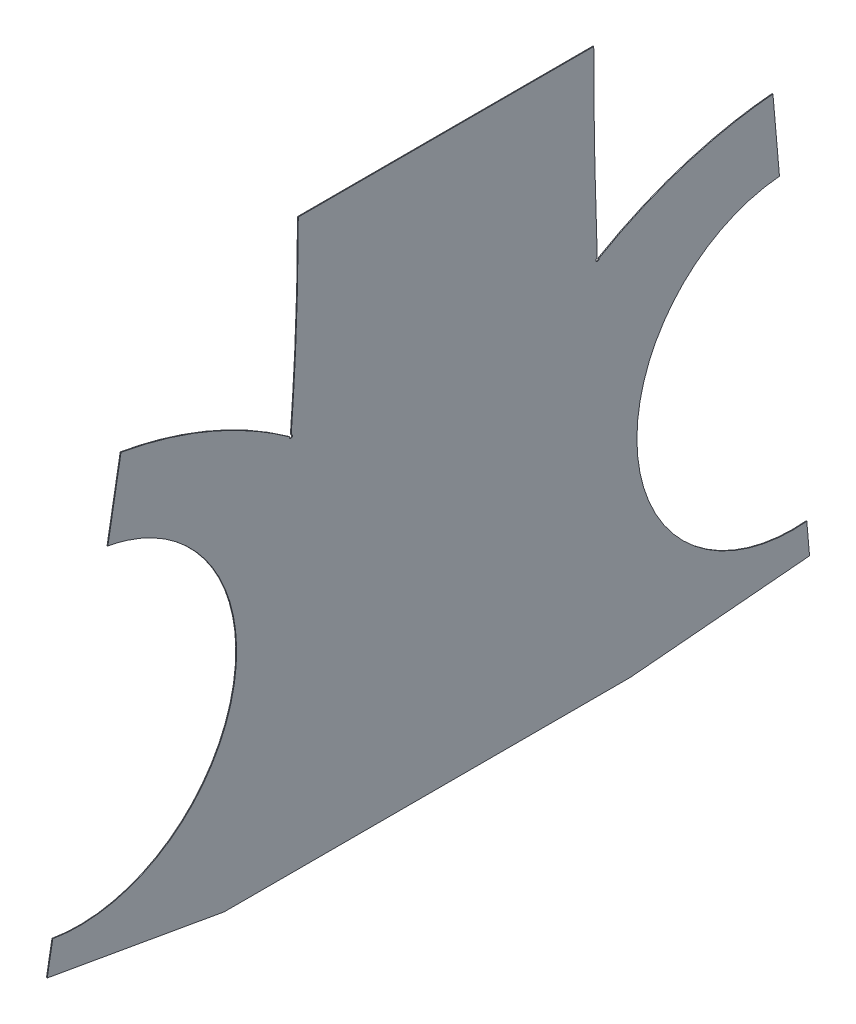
ISO-10303-21;
HEADER;
FILE_DESCRIPTION(('STEP AP214'),'2;1');
FILE_NAME('part.step','',(''),(''),'','','');
FILE_SCHEMA(('AUTOMOTIVE_DESIGN { 1 0 10303 214 1 1 1 1 }'));
ENDSEC;
DATA;
#1=APPLICATION_CONTEXT('core data for automotive mechanical design processes');
#2=APPLICATION_PROTOCOL_DEFINITION('international standard','automotive_design',2000,#1);
#3=PRODUCT_CONTEXT('',#1,'mechanical');
#4=PRODUCT('Part','Part','',(#3));
#5=PRODUCT_RELATED_PRODUCT_CATEGORY('part','',(#4));
#6=PRODUCT_DEFINITION_FORMATION('','',#4);
#7=PRODUCT_DEFINITION_CONTEXT('part definition',#1,'design');
#8=PRODUCT_DEFINITION('design','',#6,#7);
#9=PRODUCT_DEFINITION_SHAPE('','',#8);
#10=(LENGTH_UNIT() NAMED_UNIT(*) SI_UNIT(.MILLI.,.METRE.));
#11=(NAMED_UNIT(*) PLANE_ANGLE_UNIT() SI_UNIT($,.RADIAN.));
#12=(NAMED_UNIT(*) SI_UNIT($,.STERADIAN.) SOLID_ANGLE_UNIT());
#13=UNCERTAINTY_MEASURE_WITH_UNIT(LENGTH_MEASURE(1.E-05),#10,'distance_accuracy_value','');
#14=(GEOMETRIC_REPRESENTATION_CONTEXT(3) GLOBAL_UNCERTAINTY_ASSIGNED_CONTEXT((#13)) GLOBAL_UNIT_ASSIGNED_CONTEXT((#10,
#11,#12)) REPRESENTATION_CONTEXT('',''));
#15=CARTESIAN_POINT('',(0.,0.,0.));
#16=DIRECTION('',(0.,0.,1.));
#17=DIRECTION('',(1.,0.,0.));
#18=AXIS2_PLACEMENT_3D('',#15,#16,#17);
#19=CARTESIAN_POINT('',(-1.,0.,520.));
#20=DIRECTION('',(1.,0.,0.));
#21=DIRECTION('',(0.,0.,-1.));
#22=AXIS2_PLACEMENT_3D('',#19,#20,#21);
#23=PLANE('',#22);
#24=CARTESIAN_POINT('',(-1.,484.183526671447,434.625380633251));
#25=DIRECTION('',(1.,0.,0.));
#26=DIRECTION('',(0.,0.,-1.));
#27=AXIS2_PLACEMENT_3D('',#24,#25,#26);
#28=CIRCLE('',#27,2.);
#29=CARTESIAN_POINT('',(-0.999999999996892,484.857108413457,436.508539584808));
#30=VERTEX_POINT('',#29);
#31=CARTESIAN_POINT('',(-0.999999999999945,485.877678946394,433.562437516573));
#32=VERTEX_POINT('',#31);
#33=EDGE_CURVE('E349',#30,#32,#28,.T.);
#34=ORIENTED_EDGE('',*,*,#33,.T.);
#35=CARTESIAN_POINT('',(-0.999999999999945,487.848674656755,433.223061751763));
#36=DIRECTION('',(1.,0.,0.));
#37=DIRECTION('',(0.,1.,0.));
#38=AXIS2_PLACEMENT_3D('',#35,#36,#37);
#39=CIRCLE('',#38,1.99999999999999);
#40=CARTESIAN_POINT('',(-1.,486.154522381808,434.28600486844));
#41=VERTEX_POINT('',#40);
#42=EDGE_CURVE('E335',#41,#32,#39,.T.);
#43=ORIENTED_EDGE('',*,*,#42,.F.);
#44=CARTESIAN_POINT('',(-1.,722.888792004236,425.224247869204));
#45=CARTESIAN_POINT('',(-1.,660.412146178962,425.356499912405));
#46=CARTESIAN_POINT('',(-1.,604.436673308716,427.520691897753));
#47=CARTESIAN_POINT('',(-1.,551.397981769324,429.571338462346));
#48=CARTESIAN_POINT('',(-1.,486.154522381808,434.28600486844));
#49=B_SPLINE_CURVE_WITH_KNOTS('',2,(#44,#45,#46,#47,#48),.UNSPECIFIED.,.F.,.F.,(3,2,3),(0.,0.5,
1.),.UNSPECIFIED.);
#50=CARTESIAN_POINT('',(-1.00000000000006,722.888792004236,425.224247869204));
#51=VERTEX_POINT('',#50);
#52=EDGE_CURVE('E344',#51,#41,#49,.T.);
#53=ORIENTED_EDGE('',*,*,#52,.F.);
#54=DIRECTION('',(0.,0.,1.));
#55=VECTOR('',#54,1.);
#56=CARTESIAN_POINT('',(-1.,722.888792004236,238.4929751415));
#57=LINE('',#56,#55);
#58=CARTESIAN_POINT('',(-1.,722.888792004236,47.0251566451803));
#59=VERTEX_POINT('',#58);
#60=EDGE_CURVE('E343',#59,#51,#57,.T.);
#61=ORIENTED_EDGE('',*,*,#60,.F.);
#62=CARTESIAN_POINT('',(-1.,486.17634519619,42.529904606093));
#63=CARTESIAN_POINT('',(-1.,524.706977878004,43.8820597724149));
#64=CARTESIAN_POINT('',(-1.,545.336556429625,44.467634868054));
#65=CARTESIAN_POINT('',(-1.,573.439250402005,45.265335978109));
#66=CARTESIAN_POINT('',(-1.,604.51209675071,45.8560135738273));
#67=CARTESIAN_POINT('',(-1.,635.700512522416,46.4488880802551));
#68=CARTESIAN_POINT('',(-1.,663.697658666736,46.7170416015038));
#69=CARTESIAN_POINT('',(-1.,684.13104071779,46.9127502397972));
#70=CARTESIAN_POINT('',(-1.,722.888792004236,47.0251566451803));
#71=B_SPLINE_CURVE_WITH_KNOTS('',2,(#62,#63,#64,#65,#66,#67,#68,#69,#70),.UNSPECIFIED.,.F.,.F.,
(3,2,2,2,3),(0.,0.25,0.5,0.75,1.),.UNSPECIFIED.);
#72=CARTESIAN_POINT('',(-1.,486.176345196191,42.5299046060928));
#73=VERTEX_POINT('',#72);
#74=EDGE_CURVE('E357',#73,#59,#71,.T.);
#75=ORIENTED_EDGE('',*,*,#74,.F.);
#76=CARTESIAN_POINT('',(-1.,484.183526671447,42.36056964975));
#77=DIRECTION('',(1.,0.,0.));
#78=DIRECTION('',(0.,0.,-1.));
#79=AXIS2_PLACEMENT_3D('',#76,#77,#78);
#80=CIRCLE('',#79,2.);
#81=CARTESIAN_POINT('',(-0.999999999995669,484.658809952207,40.4178638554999));
#82=VERTEX_POINT('',#81);
#83=EDGE_CURVE('E425',#73,#82,#80,.T.);
#84=ORIENTED_EDGE('',*,*,#83,.T.);
#85=CARTESIAN_POINT('',(-0.999999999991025,484.312474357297,41.0096870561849));
#86=CARTESIAN_POINT('',(-0.999999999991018,486.837717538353,36.700865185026));
#87=CARTESIAN_POINT('',(-0.999999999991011,489.30251419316,32.3566209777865));
#88=CARTESIAN_POINT('',(-0.999999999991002,494.109517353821,23.6005346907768));
#89=CARTESIAN_POINT('',(-0.999999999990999,496.451717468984,19.1886891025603));
#90=CARTESIAN_POINT('',(-0.999999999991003,501.011102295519,10.3020022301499));
#91=CARTESIAN_POINT('',(-0.99999999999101,503.22831239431,5.82717397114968));
#92=CARTESIAN_POINT('',(-0.999999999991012,507.536296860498,-3.18265090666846));
#93=CARTESIAN_POINT('',(-0.999999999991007,509.627077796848,-7.71764438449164));
#94=CARTESIAN_POINT('',(-0.999999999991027,513.680618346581,-16.8447541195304));
#95=CARTESIAN_POINT('',(-0.999999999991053,515.64337175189,-21.436873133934));
#96=CARTESIAN_POINT('',(-0.999999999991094,519.439295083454,-30.6742584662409));
#97=CARTESIAN_POINT('',(-0.999999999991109,521.272467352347,-35.3195238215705));
#98=CARTESIAN_POINT('',(-0.999999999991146,524.808129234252,-44.6603772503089));
#99=CARTESIAN_POINT('',(-0.999999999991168,526.510598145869,-49.3559731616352));
#100=CARTESIAN_POINT('',(-0.999999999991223,529.783201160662,-58.7933765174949));
#101=CARTESIAN_POINT('',(-0.999999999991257,531.353326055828,-63.5351871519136));
#102=CARTESIAN_POINT('',(-0.999999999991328,534.803559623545,-74.4673308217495));
#103=CARTESIAN_POINT('',(-0.999999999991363,536.638339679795,-80.6720291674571));
#104=CARTESIAN_POINT('',(-0.999999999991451,540.081475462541,-93.144980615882));
#105=CARTESIAN_POINT('',(-0.999999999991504,541.689792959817,-99.4132442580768));
#106=CARTESIAN_POINT('',(-0.999999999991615,544.677605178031,-112.00466000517));
#107=CARTESIAN_POINT('',(-0.999999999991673,546.05708039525,-118.327816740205));
#108=CARTESIAN_POINT('',(-0.999999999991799,548.586827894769,-131.029896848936));
#109=CARTESIAN_POINT('',(-0.999999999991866,549.736745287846,-137.408890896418));
#110=CARTESIAN_POINT('',(-0.999999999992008,551.803423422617,-150.204022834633));
#111=CARTESIAN_POINT('',(-0.999999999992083,552.720202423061,-156.620157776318));
#112=CARTESIAN_POINT('',(-0.99999999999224,554.319362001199,-169.480560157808));
#113=CARTESIAN_POINT('',(-0.999999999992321,555.001778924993,-175.924823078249));
#114=CARTESIAN_POINT('',(-0.999999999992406,555.566477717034,-182.379394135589));
#115=B_SPLINE_CURVE_WITH_KNOTS('',3,(#85,#86,#87,#88,#89,#90,#91,#92,#93,#94,#95,#96,#97,#98,
#99,#100,#101,#102,#103,#104,#105,#106,#107,#108,#109,#110,#111,#112,#113,#114),.UNSPECIFIED.,
.F.,.F.,(4,2,2,2,2,2,2,2,2,2,2,2,2,2,4),(0.,14.9823351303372,29.9654504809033,44.945511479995,
59.9247934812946,74.904801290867,89.8845382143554,104.866642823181,119.849788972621,
139.256211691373,158.665906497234,178.077254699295,197.518383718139,216.957989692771,
236.394579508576),.UNSPECIFIED.);
#116=CARTESIAN_POINT('',(-0.999999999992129,555.566477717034,-182.379394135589));
#117=VERTEX_POINT('',#116);
#118=EDGE_CURVE('E432',#82,#117,#115,.T.);
#119=ORIENTED_EDGE('',*,*,#118,.T.);
#120=DIRECTION('',(0.,-0.996194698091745,-0.0871557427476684));
#121=VECTOR('',#120,1.);
#122=CARTESIAN_POINT('',(-1.00000000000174,20.0550762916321,-229.230570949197));
#123=LINE('',#122,#121);
#124=CARTESIAN_POINT('',(-0.999999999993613,460.055076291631,-190.735558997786));
#125=VERTEX_POINT('',#124);
#126=EDGE_CURVE('E483',#117,#125,#123,.T.);
#127=ORIENTED_EDGE('',*,*,#126,.T.);
#128=CARTESIAN_POINT('',(-1.000000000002,260.055076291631,-208.23329170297));
#129=DIRECTION('',(1.,0.,0.));
#130=DIRECTION('',(0.,-0.996194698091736,-0.0871557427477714));
#131=AXIS2_PLACEMENT_3D('',#128,#129,#130);
#132=ELLIPSE('',#131,200.76396750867,200.);
#133=CARTESIAN_POINT('',(-1.000000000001,60.0550762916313,-225.73102440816));
#134=VERTEX_POINT('',#133);
#135=EDGE_CURVE('E522',#134,#125,#132,.F.);
#136=ORIENTED_EDGE('',*,*,#135,.F.);
#137=CARTESIAN_POINT('',(-1.00000000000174,20.0550762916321,-229.230570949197));
#138=VERTEX_POINT('',#137);
#139=EDGE_CURVE('E505',#134,#138,#123,.T.);
#140=ORIENTED_EDGE('',*,*,#139,.T.);
#141=DIRECTION('',(0.,-0.0871557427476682,0.996194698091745));
#142=VECTOR('',#141,1.);
#143=CARTESIAN_POINT('',(-1.00000000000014,0.0310443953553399,-0.354839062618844));
#144=LINE('',#143,#142);
#145=CARTESIAN_POINT('',(-1.00000000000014,0.118200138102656,-1.35103376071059));
#146=VERTEX_POINT('',#145);
#147=EDGE_CURVE('E503',#138,#146,#144,.T.);
#148=ORIENTED_EDGE('',*,*,#147,.T.);
#149=DIRECTION('',(0.,0.0501311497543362,-0.998742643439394));
#150=VECTOR('',#149,1.);
#151=CARTESIAN_POINT('',(-1.00000000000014,-1.66172871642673E-13,1.0038198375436));
#152=LINE('',#151,#150);
#153=CARTESIAN_POINT('',(-0.999999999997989,-1.11022302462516E-13,1.0038198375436));
#154=VERTEX_POINT('',#153);
#155=EDGE_CURVE('E534',#154,#146,#152,.T.);
#156=ORIENTED_EDGE('',*,*,#155,.F.);
#157=DIRECTION('',(0.,0.,-1.));
#158=VECTOR('',#157,1.);
#159=CARTESIAN_POINT('',(-1.,0.,520.));
#160=LINE('',#159,#158);
#161=CARTESIAN_POINT('',(-0.99999999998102,2.71511380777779E-13,518.984573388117));
#162=VERTEX_POINT('',#161);
#163=EDGE_CURVE('E220',#162,#154,#160,.T.);
#164=ORIENTED_EDGE('',*,*,#163,.F.);
#165=DIRECTION('',(0.,-0.0996708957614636,-0.995020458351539));
#166=VECTOR('',#165,1.);
#167=CARTESIAN_POINT('',(-0.999999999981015,0.235500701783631,521.335590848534));
#168=LINE('',#167,#166);
#169=CARTESIAN_POINT('',(-0.999999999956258,0.235500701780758,521.335590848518));
#170=VERTEX_POINT('',#169);
#171=EDGE_CURVE('E213',#170,#162,#168,.T.);
#172=ORIENTED_EDGE('',*,*,#171,.F.);
#173=DIRECTION('',(0.,0.173648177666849,0.984807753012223));
#174=VECTOR('',#173,1.);
#175=CARTESIAN_POINT('',(-0.999999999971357,39.9575213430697,746.610364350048));
#176=LINE('',#175,#174);
#177=CARTESIAN_POINT('',(-0.999999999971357,39.9575213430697,746.610364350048));
#178=VERTEX_POINT('',#177);
#179=EDGE_CURVE('E596',#170,#178,#176,.T.);
#180=ORIENTED_EDGE('',*,*,#179,.T.);
#181=DIRECTION('',(0.,0.984807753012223,-0.173648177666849));
#182=VECTOR('',#181,1.);
#183=CARTESIAN_POINT('',(-1.00000000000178,575.502867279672,652.179270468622));
#184=LINE('',#183,#182);
#185=CARTESIAN_POINT('',(-0.999999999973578,79.8710289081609,739.572536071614));
#186=VERTEX_POINT('',#185);
#187=EDGE_CURVE('E593',#178,#186,#184,.T.);
#188=ORIENTED_EDGE('',*,*,#187,.T.);
#189=CARTESIAN_POINT('',(-0.999999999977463,279.87102890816,704.307139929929));
#190=DIRECTION('',(1.,0.,0.));
#191=DIRECTION('',(0.,0.984807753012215,-0.173648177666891));
#192=AXIS2_PLACEMENT_3D('',#189,#190,#191);
#193=ELLIPSE('',#192,203.085322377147,200.);
#194=CARTESIAN_POINT('',(-0.999999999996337,479.871028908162,669.041743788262));
#195=VERTEX_POINT('',#194);
#196=EDGE_CURVE('E643',#195,#186,#193,.F.);
#197=ORIENTED_EDGE('',*,*,#196,.F.);
#198=CARTESIAN_POINT('',(-1.00000000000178,575.502867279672,652.179270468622));
#199=VERTEX_POINT('',#198);
#200=EDGE_CURVE('E601',#195,#199,#184,.T.);
#201=ORIENTED_EDGE('',*,*,#200,.T.);
#202=CARTESIAN_POINT('',(-0.999999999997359,484.857109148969,436.508539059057));
#203=CARTESIAN_POINT('',(-0.999999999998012,496.211562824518,452.393505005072));
#204=CARTESIAN_POINT('',(-0.999999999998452,506.682876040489,468.893920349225));
#205=CARTESIAN_POINT('',(-0.999999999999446,525.844742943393,503.126230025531));
#206=CARTESIAN_POINT('',(-1.,534.513294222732,520.870057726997));
#207=CARTESIAN_POINT('',(-1.00000000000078,549.81034196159,557.200968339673));
#208=CARTESIAN_POINT('',(-1.00000000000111,556.43880078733,575.787961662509));
#209=CARTESIAN_POINT('',(-1.00000000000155,567.5750605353,613.579173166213));
#210=CARTESIAN_POINT('',(-1.00000000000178,572.082834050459,632.783298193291));
#211=CARTESIAN_POINT('',(-1.00000000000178,575.502867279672,652.179270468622));
#212=B_SPLINE_CURVE_WITH_KNOTS('',3,(#202,#203,#204,#205,#206,#207,#208,#209,#210,#211),
.UNSPECIFIED.,.F.,.F.,(4,2,2,2,4),(0.,0.247146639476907,0.497146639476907,0.747146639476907,
0.997146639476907),.UNSPECIFIED.);
#213=EDGE_CURVE('E582',#199,#30,#212,.F.);
#214=ORIENTED_EDGE('',*,*,#213,.T.);
#215=EDGE_LOOP('',(#34,#43,#53,#61,#75,#84,#119,#127,#136,#140,#148,#156,#164,#172,#180,#188,
#197,#201,#214));
#216=FACE_BOUND('',#215,.T.);
#217=ADVANCED_FACE('F196',(#216),#23,.F.);
#218=CARTESIAN_POINT('',(0.,0.,520.));
#219=DIRECTION('',(1.,0.,0.));
#220=DIRECTION('',(0.,0.,-1.));
#221=AXIS2_PLACEMENT_3D('',#218,#219,#220);
#222=PLANE('',#221);
#223=CARTESIAN_POINT('',(0.,484.183526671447,42.36056964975));
#224=DIRECTION('',(1.,0.,0.));
#225=DIRECTION('',(0.,0.,-1.));
#226=AXIS2_PLACEMENT_3D('',#223,#224,#225);
#227=CIRCLE('',#226,2.);
#228=CARTESIAN_POINT('',(0.,486.17634519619,42.5299046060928));
#229=VERTEX_POINT('',#228);
#230=CARTESIAN_POINT('',(8.97409504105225E-12,484.658809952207,40.4178638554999));
#231=VERTEX_POINT('',#230);
#232=EDGE_CURVE('E415',#229,#231,#227,.T.);
#233=ORIENTED_EDGE('',*,*,#232,.F.);
#234=CARTESIAN_POINT('',(0.,486.17634519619,42.529904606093));
#235=CARTESIAN_POINT('',(0.,524.706977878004,43.8820597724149));
#236=CARTESIAN_POINT('',(0.,545.336556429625,44.467634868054));
#237=CARTESIAN_POINT('',(0.,573.439250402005,45.265335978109));
#238=CARTESIAN_POINT('',(0.,604.51209675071,45.8560135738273));
#239=CARTESIAN_POINT('',(0.,635.700512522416,46.4488880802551));
#240=CARTESIAN_POINT('',(0.,663.697658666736,46.7170416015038));
#241=CARTESIAN_POINT('',(0.,684.13104071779,46.9127502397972));
#242=CARTESIAN_POINT('',(0.,722.888792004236,47.0251566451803));
#243=B_SPLINE_CURVE_WITH_KNOTS('',2,(#234,#235,#236,#237,#238,#239,#240,#241,#242),
.UNSPECIFIED.,.F.,.F.,(3,2,2,2,3),(0.,0.25,0.5,0.75,1.),.UNSPECIFIED.);
#244=CARTESIAN_POINT('',(0.,722.888792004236,47.0251566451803));
#245=VERTEX_POINT('',#244);
#246=EDGE_CURVE('E393',#229,#245,#243,.T.);
#247=ORIENTED_EDGE('',*,*,#246,.T.);
#248=DIRECTION('',(0.,0.,1.));
#249=VECTOR('',#248,1.);
#250=CARTESIAN_POINT('',(6.7168492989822E-12,722.888792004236,47.0251566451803));
#251=LINE('',#250,#249);
#252=CARTESIAN_POINT('',(6.7168492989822E-12,722.888792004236,425.224247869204));
#253=VERTEX_POINT('',#252);
#254=EDGE_CURVE('E392',#245,#253,#251,.T.);
#255=ORIENTED_EDGE('',*,*,#254,.T.);
#256=CARTESIAN_POINT('',(0.,722.888792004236,425.224247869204));
#257=CARTESIAN_POINT('',(0.,660.412146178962,425.356499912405));
#258=CARTESIAN_POINT('',(0.,604.436673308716,427.520691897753));
#259=CARTESIAN_POINT('',(0.,551.397981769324,429.571338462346));
#260=CARTESIAN_POINT('',(0.,486.154522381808,434.28600486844));
#261=B_SPLINE_CURVE_WITH_KNOTS('',2,(#256,#257,#258,#259,#260),.UNSPECIFIED.,.F.,.F.,(3,2,3),
(0.,0.5,1.),.UNSPECIFIED.);
#262=CARTESIAN_POINT('',(0.,486.154522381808,434.28600486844));
#263=VERTEX_POINT('',#262);
#264=EDGE_CURVE('E385',#253,#263,#261,.T.);
#265=ORIENTED_EDGE('',*,*,#264,.T.);
#266=CARTESIAN_POINT('',(0.,487.848674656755,433.223061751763));
#267=DIRECTION('',(1.,0.,0.));
#268=DIRECTION('',(0.,1.,0.));
#269=AXIS2_PLACEMENT_3D('',#266,#267,#268);
#270=CIRCLE('',#269,1.99999999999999);
#271=CARTESIAN_POINT('',(0.,485.877678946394,433.562437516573));
#272=VERTEX_POINT('',#271);
#273=EDGE_CURVE('E338',#263,#272,#270,.T.);
#274=ORIENTED_EDGE('',*,*,#273,.T.);
#275=CARTESIAN_POINT('',(0.,484.183526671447,434.625380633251));
#276=DIRECTION('',(1.,0.,0.));
#277=DIRECTION('',(0.,0.,-1.));
#278=AXIS2_PLACEMENT_3D('',#275,#276,#277);
#279=CIRCLE('',#278,2.);
#280=CARTESIAN_POINT('',(3.10862446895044E-12,484.857108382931,436.508539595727));
#281=VERTEX_POINT('',#280);
#282=EDGE_CURVE('E644',#281,#272,#279,.T.);
#283=ORIENTED_EDGE('',*,*,#282,.F.);
#284=CARTESIAN_POINT('',(0.,575.502867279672,652.179270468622));
#285=CARTESIAN_POINT('',(0.,574.64276072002,647.301349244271));
#286=CARTESIAN_POINT('',(0.,573.7138521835,642.435563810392));
#287=CARTESIAN_POINT('',(0.,571.719288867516,632.731839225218));
#288=CARTESIAN_POINT('',(0.,570.653627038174,627.893901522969));
#289=CARTESIAN_POINT('',(0.,568.386763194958,618.251054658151));
#290=CARTESIAN_POINT('',(0.,567.185592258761,613.446138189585));
#291=CARTESIAN_POINT('',(0.,564.648500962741,603.872280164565));
#292=CARTESIAN_POINT('',(0.,563.312587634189,599.103336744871));
#293=CARTESIAN_POINT('',(0.,560.506839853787,589.604773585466));
#294=CARTESIAN_POINT('',(0.,559.036999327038,584.875155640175));
#295=CARTESIAN_POINT('',(0.,555.964843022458,575.459243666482));
#296=CARTESIAN_POINT('',(0.,554.362529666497,570.772948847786));
#297=CARTESIAN_POINT('',(0.,551.026472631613,561.446440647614));
#298=CARTESIAN_POINT('',(0.,549.292706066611,556.80623545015));
#299=CARTESIAN_POINT('',(0.,545.69525994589,547.576135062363));
#300=CARTESIAN_POINT('',(0.,543.831571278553,542.986243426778));
#301=CARTESIAN_POINT('',(0.,539.375432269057,532.439902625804));
#302=CARTESIAN_POINT('',(0.,536.736747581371,526.502920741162));
#303=CARTESIAN_POINT('',(0.,531.242134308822,514.729170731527));
#304=CARTESIAN_POINT('',(0.,528.386167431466,508.892420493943));
#305=CARTESIAN_POINT('',(0.,522.461137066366,497.327393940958));
#306=CARTESIAN_POINT('',(0.,519.392053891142,491.599127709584));
#307=CARTESIAN_POINT('',(0.,513.040221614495,480.250694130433));
#308=CARTESIAN_POINT('',(0.,509.757149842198,474.630707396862));
#309=CARTESIAN_POINT('',(0.,502.986842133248,463.515754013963));
#310=CARTESIAN_POINT('',(0.,499.499623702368,458.020776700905));
#311=CARTESIAN_POINT('',(0.,492.326356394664,447.16356269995));
#312=CARTESIAN_POINT('',(0.,488.640342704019,441.801302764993));
#313=CARTESIAN_POINT('',(0.,484.857109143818,436.50853905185));
#314=B_SPLINE_CURVE_WITH_KNOTS('',3,(#284,#285,#286,#287,#288,#289,#290,#291,#292,#293,#294,
#295,#296,#297,#298,#299,#300,#301,#302,#303,#304,#305,#306,#307,#308,#309,#310,#311,#312,#313),
.UNSPECIFIED.,.F.,.F.,(4,2,2,2,2,2,2,2,2,2,2,2,2,2,4),(0.,14.8590136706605,29.7187936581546,
44.5751726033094,59.4307766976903,74.2870549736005,89.1430617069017,104.001660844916,
118.861303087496,138.347557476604,157.837253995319,177.32875335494,196.850355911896,
216.370286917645,235.886774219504),.UNSPECIFIED.);
#315=CARTESIAN_POINT('',(-1.77635683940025E-12,575.502867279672,652.179270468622));
#316=VERTEX_POINT('',#315);
#317=EDGE_CURVE('E547',#316,#281,#314,.T.);
#318=ORIENTED_EDGE('',*,*,#317,.F.);
#319=DIRECTION('',(0.,0.984807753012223,-0.173648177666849));
#320=VECTOR('',#319,1.);
#321=CARTESIAN_POINT('',(-1.77635683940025E-12,575.502867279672,652.179270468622));
#322=LINE('',#321,#320);
#323=CARTESIAN_POINT('',(3.66373598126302E-12,480.044677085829,669.011124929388));
#324=VERTEX_POINT('',#323);
#325=EDGE_CURVE('E606',#324,#316,#322,.T.);
#326=ORIENTED_EDGE('',*,*,#325,.F.);
#327=CARTESIAN_POINT('',(2.24265050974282E-11,280.044677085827,704.276521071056));
#328=DIRECTION('',(1.,0.,0.));
#329=DIRECTION('',(0.,0.984807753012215,-0.173648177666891));
#330=AXIS2_PLACEMENT_3D('',#327,#328,#329);
#331=ELLIPSE('',#330,203.085322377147,200.);
#332=CARTESIAN_POINT('',(2.64233079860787E-11,80.0446770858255,739.541917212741));
#333=VERTEX_POINT('',#332);
#334=EDGE_CURVE('E603',#324,#333,#331,.F.);
#335=ORIENTED_EDGE('',*,*,#334,.T.);
#336=CARTESIAN_POINT('',(2.87547763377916E-11,39.9575213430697,746.610364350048));
#337=VERTEX_POINT('',#336);
#338=EDGE_CURVE('E612',#337,#333,#322,.T.);
#339=ORIENTED_EDGE('',*,*,#338,.F.);
#340=DIRECTION('',(0.,0.173648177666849,0.984807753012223));
#341=VECTOR('',#340,1.);
#342=CARTESIAN_POINT('',(2.87547763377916E-11,39.9575213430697,746.610364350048));
#343=LINE('',#342,#341);
#344=CARTESIAN_POINT('',(3.96349619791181E-11,0.235500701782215,521.335590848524));
#345=VERTEX_POINT('',#344);
#346=EDGE_CURVE('E586',#345,#337,#343,.T.);
#347=ORIENTED_EDGE('',*,*,#346,.F.);
#348=DIRECTION('',(0.,-0.0996708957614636,-0.995020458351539));
#349=VECTOR('',#348,1.);
#350=CARTESIAN_POINT('',(1.89854642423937E-11,0.235500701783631,521.335590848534));
#351=LINE('',#350,#349);
#352=CARTESIAN_POINT('',(1.89796257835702E-11,0.,518.984573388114));
#353=VERTEX_POINT('',#352);
#354=EDGE_CURVE('E433',#345,#353,#351,.T.);
#355=ORIENTED_EDGE('',*,*,#354,.T.);
#356=DIRECTION('',(0.,0.,-1.));
#357=VECTOR('',#356,1.);
#358=CARTESIAN_POINT('',(0.,0.,520.));
#359=LINE('',#358,#357);
#360=CARTESIAN_POINT('',(-1.42877315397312E-13,-1.66533453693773E-13,1.0038198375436));
#361=VERTEX_POINT('',#360);
#362=EDGE_CURVE('E544',#353,#361,#359,.T.);
#363=ORIENTED_EDGE('',*,*,#362,.T.);
#364=DIRECTION('',(0.,0.0501311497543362,-0.998742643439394));
#365=VECTOR('',#364,1.);
#366=CARTESIAN_POINT('',(-1.42856784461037E-13,-1.66172871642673E-13,1.0038198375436));
#367=LINE('',#366,#365);
#368=CARTESIAN_POINT('',(0.,0.118200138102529,-1.35103376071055));
#369=VERTEX_POINT('',#368);
#370=EDGE_CURVE('E426',#361,#369,#367,.T.);
#371=ORIENTED_EDGE('',*,*,#370,.T.);
#372=DIRECTION('',(0.,-0.0871557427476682,0.996194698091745));
#373=VECTOR('',#372,1.);
#374=CARTESIAN_POINT('',(-1.3586357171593E-13,0.0310443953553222,-0.354839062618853));
#375=LINE('',#374,#373);
#376=CARTESIAN_POINT('',(-1.74070379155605E-12,20.0550762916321,-229.230570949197));
#377=VERTEX_POINT('',#376);
#378=EDGE_CURVE('E508',#377,#369,#375,.T.);
#379=ORIENTED_EDGE('',*,*,#378,.F.);
#380=DIRECTION('',(0.,-0.996194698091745,-0.0871557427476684));
#381=VECTOR('',#380,1.);
#382=CARTESIAN_POINT('',(-1.74070379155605E-12,20.0550762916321,-229.230570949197));
#383=LINE('',#382,#381);
#384=CARTESIAN_POINT('',(-1.00474020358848E-12,60.1422320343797,-225.723399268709));
#385=VERTEX_POINT('',#384);
#386=EDGE_CURVE('E517',#385,#377,#383,.T.);
#387=ORIENTED_EDGE('',*,*,#386,.F.);
#388=CARTESIAN_POINT('',(-2.01565030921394E-12,260.142232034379,-208.225666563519));
#389=DIRECTION('',(1.,0.,0.));
#390=DIRECTION('',(0.,-0.996194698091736,-0.0871557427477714));
#391=AXIS2_PLACEMENT_3D('',#388,#389,#390);
#392=ELLIPSE('',#391,200.76396750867,200.);
#393=CARTESIAN_POINT('',(6.3804113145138E-12,460.14223203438,-190.727933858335));
#394=VERTEX_POINT('',#393);
#395=EDGE_CURVE('E515',#385,#394,#392,.F.);
#396=ORIENTED_EDGE('',*,*,#395,.T.);
#397=CARTESIAN_POINT('',(7.86533460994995E-12,555.566477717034,-182.379394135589));
#398=VERTEX_POINT('',#397);
#399=EDGE_CURVE('E438',#398,#394,#383,.T.);
#400=ORIENTED_EDGE('',*,*,#399,.F.);
#401=CARTESIAN_POINT('',(8.96931999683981E-12,484.312477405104,41.0096818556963));
#402=CARTESIAN_POINT('',(8.97854698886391E-12,486.812617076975,36.7436935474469));
#403=CARTESIAN_POINT('',(8.98409307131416E-12,489.253506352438,32.4429837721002));
#404=CARTESIAN_POINT('',(8.99090369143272E-12,494.015136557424,23.7752720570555));
#405=CARTESIAN_POINT('',(8.99216801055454E-12,496.335871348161,19.4082667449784));
#406=CARTESIAN_POINT('',(8.99349491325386E-12,500.854771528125,10.6125589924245));
#407=CARTESIAN_POINT('',(8.99355777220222E-12,503.052964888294,6.18387092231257));
#408=CARTESIAN_POINT('',(8.97398830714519E-12,507.325582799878,-2.73279745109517));
#409=CARTESIAN_POINT('',(8.95435604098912E-12,509.400007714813,-7.22077758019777));
#410=CARTESIAN_POINT('',(8.93393314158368E-12,513.423377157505,-16.2527636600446));
#411=CARTESIAN_POINT('',(8.93314295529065E-12,515.372318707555,-20.7967709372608));
#412=CARTESIAN_POINT('',(8.91183637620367E-12,519.143249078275,-29.9370574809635));
#413=CARTESIAN_POINT('',(8.89132034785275E-12,520.965240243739,-34.5333357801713));
#414=CARTESIAN_POINT('',(8.84929024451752E-12,524.481214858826,-43.7754483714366));
#415=CARTESIAN_POINT('',(8.82777601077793E-12,526.175177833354,-48.4212904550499));
#416=CARTESIAN_POINT('',(8.77983605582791E-12,529.433492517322,-57.7585268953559));
#417=CARTESIAN_POINT('',(8.75340998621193E-12,530.997835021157,-62.4499244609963));
#418=CARTESIAN_POINT('',(8.68543716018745E-12,534.477403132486,-73.3898159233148));
#419=CARTESIAN_POINT('',(8.64176064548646E-12,536.343714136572,-79.653937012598));
#420=CARTESIAN_POINT('',(8.54720699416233E-12,539.845391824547,-92.2474956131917));
#421=CARTESIAN_POINT('',(8.49632859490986E-12,541.48071791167,-98.5769443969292));
#422=CARTESIAN_POINT('',(8.3862111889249E-12,544.517960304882,-111.292218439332));
#423=CARTESIAN_POINT('',(8.32697144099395E-12,545.919855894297,-117.678048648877));
#424=CARTESIAN_POINT('',(8.20011366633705E-12,548.489867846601,-130.507175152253));
#425=CARTESIAN_POINT('',(8.13248242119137E-12,549.657607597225,-136.950546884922));
#426=CARTESIAN_POINT('',(7.99020845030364E-12,551.755141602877,-149.875363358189));
#427=CARTESIAN_POINT('',(7.91556629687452E-12,552.684955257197,-156.356804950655));
#428=CARTESIAN_POINT('',(7.75463237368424E-12,554.305360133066,-169.348458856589));
#429=CARTESIAN_POINT('',(7.66834248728E-12,554.995989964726,-175.858666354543));
#430=CARTESIAN_POINT('',(7.57390106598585E-12,555.566477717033,-182.379394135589));
#431=B_SPLINE_CURVE_WITH_KNOTS('',3,(#401,#402,#403,#404,#405,#406,#407,#408,#409,#410,#411,
#412,#413,#414,#415,#416,#417,#418,#419,#420,#421,#422,#423,#424,#425,#426,#427,#428,#429,#430),
.UNSPECIFIED.,.F.,.F.,(4,2,2,2,2,2,2,2,2,2,2,2,2,2,4),(0.,14.8334065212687,29.6675701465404,
44.498333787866,59.3290538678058,74.1601257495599,88.9909236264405,103.824088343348,
118.658305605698,138.262393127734,157.869921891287,177.479189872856,197.119748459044,
216.758705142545,236.394490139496),.UNSPECIFIED.);
#432=EDGE_CURVE('E430',#231,#398,#431,.T.);
#433=ORIENTED_EDGE('',*,*,#432,.F.);
#434=EDGE_LOOP('',(#233,#247,#255,#265,#274,#283,#318,#326,#335,#339,#347,#355,#363,#371,#379,
#387,#396,#400,#433));
#435=FACE_BOUND('',#434,.T.);
#436=ADVANCED_FACE('F198',(#435),#222,.T.);
#437=CARTESIAN_POINT('',(0.,0.,520.));
#438=DIRECTION('',(0.,-1.,0.));
#439=DIRECTION('',(0.,0.,-1.));
#440=AXIS2_PLACEMENT_3D('',#437,#438,#439);
#441=PLANE('',#440);
#442=DIRECTION('',(1.,0.,0.));
#443=VECTOR('',#442,1.);
#444=CARTESIAN_POINT('',(0.,0.,1.00381983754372));
#445=LINE('',#444,#443);
#446=EDGE_CURVE('E206',#154,#361,#445,.T.);
#447=ORIENTED_EDGE('',*,*,#446,.T.);
#448=ORIENTED_EDGE('',*,*,#362,.F.);
#449=DIRECTION('',(1.,0.,0.));
#450=VECTOR('',#449,1.);
#451=CARTESIAN_POINT('',(1.89796257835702E-11,0.,518.984573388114));
#452=LINE('',#451,#450);
#453=EDGE_CURVE('E14',#162,#353,#452,.T.);
#454=ORIENTED_EDGE('',*,*,#453,.F.);
#455=ORIENTED_EDGE('',*,*,#163,.T.);
#456=EDGE_LOOP('',(#447,#448,#454,#455));
#457=FACE_BOUND('',#456,.T.);
#458=ADVANCED_FACE('F373',(#457),#441,.T.);
#459=CARTESIAN_POINT('',(-1.,484.183526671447,434.625380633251));
#460=DIRECTION('',(1.,0.,0.));
#461=DIRECTION('',(0.,0.,-1.));
#462=AXIS2_PLACEMENT_3D('',#459,#460,#461);
#463=CYLINDRICAL_SURFACE('',#462,2.);
#464=ORIENTED_EDGE('',*,*,#33,.F.);
#465=DIRECTION('',(1.,0.,0.));
#466=VECTOR('',#465,1.);
#467=CARTESIAN_POINT('',(-0.999999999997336,484.857109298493,436.508539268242));
#468=LINE('',#467,#466);
#469=EDGE_CURVE('E554',#281,#30,#468,.F.);
#470=ORIENTED_EDGE('',*,*,#469,.F.);
#471=ORIENTED_EDGE('',*,*,#282,.T.);
#472=DIRECTION('',(1.,0.,0.));
#473=VECTOR('',#472,1.);
#474=CARTESIAN_POINT('',(0.,485.877678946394,433.562437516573));
#475=LINE('',#474,#473);
#476=EDGE_CURVE('E350',#32,#272,#475,.T.);
#477=ORIENTED_EDGE('',*,*,#476,.F.);
#478=EDGE_LOOP('',(#464,#470,#471,#477));
#479=FACE_BOUND('',#478,.T.);
#480=ADVANCED_FACE('F375',(#479),#463,.F.);
#481=CARTESIAN_POINT('',(-1.,484.183526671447,42.36056964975));
#482=DIRECTION('',(1.,0.,0.));
#483=DIRECTION('',(0.,0.,-1.));
#484=AXIS2_PLACEMENT_3D('',#481,#482,#483);
#485=CYLINDRICAL_SURFACE('',#484,2.);
#486=ORIENTED_EDGE('',*,*,#232,.T.);
#487=DIRECTION('',(1.,0.,0.));
#488=VECTOR('',#487,1.);
#489=CARTESIAN_POINT('',(-0.9999999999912,484.658809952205,40.4178638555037));
#490=LINE('',#489,#488);
#491=EDGE_CURVE('E417',#82,#231,#490,.T.);
#492=ORIENTED_EDGE('',*,*,#491,.F.);
#493=ORIENTED_EDGE('',*,*,#83,.F.);
#494=DIRECTION('',(1.,0.,0.));
#495=VECTOR('',#494,1.);
#496=CARTESIAN_POINT('',(-1.,486.17634519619,42.5299046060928));
#497=LINE('',#496,#495);
#498=EDGE_CURVE('E351',#73,#229,#497,.T.);
#499=ORIENTED_EDGE('',*,*,#498,.T.);
#500=EDGE_LOOP('',(#486,#492,#493,#499));
#501=FACE_BOUND('',#500,.T.);
#502=ADVANCED_FACE('F401',(#501),#485,.F.);
#503=CARTESIAN_POINT('',(-1.42856784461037E-13,-1.66172871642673E-13,1.0038198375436));
#504=DIRECTION('',(0.,-0.998742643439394,-0.0501311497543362));
#505=DIRECTION('',(0.,0.0501311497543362,-0.998742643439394));
#506=AXIS2_PLACEMENT_3D('',#503,#504,#505);
#507=PLANE('',#506);
#508=ORIENTED_EDGE('',*,*,#446,.F.);
#509=ORIENTED_EDGE('',*,*,#155,.T.);
#510=CARTESIAN_POINT('',(-0.999999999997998,0.118200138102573,-1.35103376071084));
#511=DIRECTION('',(1.,0.,0.));
#512=VECTOR('',#511,1.);
#513=LINE('',#510,#512);
#514=EDGE_CURVE('E478',#146,#369,#513,.T.);
#515=ORIENTED_EDGE('',*,*,#514,.T.);
#516=ORIENTED_EDGE('',*,*,#370,.F.);
#517=EDGE_LOOP('',(#508,#509,#515,#516));
#518=FACE_BOUND('',#517,.T.);
#519=ADVANCED_FACE('F404',(#518),#507,.T.);
#520=CARTESIAN_POINT('',(-0.999999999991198,483.116906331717,43.049690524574));
#521=CARTESIAN_POINT('',(-0.9999999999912,483.515531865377,42.3695138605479));
#522=CARTESIAN_POINT('',(-0.999999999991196,483.914157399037,41.6893371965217));
#523=CARTESIAN_POINT('',(-0.999999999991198,484.312782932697,41.0091605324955));
#524=CARTESIAN_POINT('',(-0.999999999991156,494.278421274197,24.0047439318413));
#525=CARTESIAN_POINT('',(-0.999999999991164,503.301026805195,6.45146785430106));
#526=CARTESIAN_POINT('',(-0.99999999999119,519.350532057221,-29.5394849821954));
#527=CARTESIAN_POINT('',(-0.999999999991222,526.377392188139,-47.9770728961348));
#528=CARTESIAN_POINT('',(-0.999999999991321,538.349939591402,-85.512409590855));
#529=CARTESIAN_POINT('',(-0.99999999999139,543.295597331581,-104.610065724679));
#530=CARTESIAN_POINT('',(-0.999999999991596,551.045582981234,-143.233272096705));
#531=CARTESIAN_POINT('',(-0.999999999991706,553.849891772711,-162.758727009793));
#532=CARTESIAN_POINT('',(-0.999999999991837,555.566477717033,-182.379394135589));
#533=B_SPLINE_CURVE_WITH_KNOTS('',3,(#520,#521,#522,#523,#524,#525,#526,#527,#528,#529,#530,
#531,#532),.UNSPECIFIED.,.F.,.F.,(4,3,2,2,2,4),(-0.01,0.,0.25,0.5,0.75,1.),.UNSPECIFIED.);
#534=DIRECTION('',(1.,0.,0.));
#535=VECTOR('',#534,1.);
#536=SURFACE_OF_LINEAR_EXTRUSION('',#533,#535);
#537=ORIENTED_EDGE('',*,*,#118,.F.);
#538=ORIENTED_EDGE('',*,*,#491,.T.);
#539=ORIENTED_EDGE('',*,*,#432,.T.);
#540=DIRECTION('',(1.,0.,0.));
#541=VECTOR('',#540,1.);
#542=CARTESIAN_POINT('',(-0.999999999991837,555.566477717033,-182.379394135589));
#543=LINE('',#542,#541);
#544=EDGE_CURVE('E439',#117,#398,#543,.T.);
#545=ORIENTED_EDGE('',*,*,#544,.F.);
#546=EDGE_LOOP('',(#537,#538,#539,#545));
#547=FACE_BOUND('',#546,.T.);
#548=ADVANCED_FACE('F410',(#547),#536,.F.);
#549=CARTESIAN_POINT('',(-1.00000000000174,20.0550762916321,-229.230570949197));
#550=DIRECTION('',(0.,-0.0871557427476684,0.996194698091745));
#551=DIRECTION('',(0.996194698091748,0.0868240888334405,0.00759612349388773));
#552=AXIS2_PLACEMENT_3D('',#549,#550,#551);
#553=PLANE('',#552);
#554=DIRECTION('',(-0.996194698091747,-0.0868240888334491,-0.00759612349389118));
#555=VECTOR('',#554,1.);
#556=CARTESIAN_POINT('',(480.64869572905,502.03352611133,-187.062920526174));
#557=LINE('',#556,#555);
#558=EDGE_CURVE('E520',#125,#394,#557,.F.);
#559=ORIENTED_EDGE('',*,*,#558,.F.);
#560=ORIENTED_EDGE('',*,*,#126,.F.);
#561=ORIENTED_EDGE('',*,*,#544,.T.);
#562=ORIENTED_EDGE('',*,*,#399,.T.);
#563=EDGE_LOOP('',(#559,#560,#561,#562));
#564=FACE_BOUND('',#563,.T.);
#565=ADVANCED_FACE('F459',(#564),#553,.F.);
#566=CARTESIAN_POINT('',(498.079844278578,303.552750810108,-204.427738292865));
#567=DIRECTION('',(-0.996194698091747,-0.0868240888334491,-0.00759612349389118));
#568=DIRECTION('',(0.,-0.0871557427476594,0.996194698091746));
#569=AXIS2_PLACEMENT_3D('',#566,#567,#568);
#570=CYLINDRICAL_SURFACE('',#569,200.);
#571=DIRECTION('',(-0.996194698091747,-0.0868240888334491,-0.00759612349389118));
#572=VECTOR('',#571,1.);
#573=CARTESIAN_POINT('',(515.510992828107,105.071975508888,-221.792556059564));
#574=LINE('',#573,#572);
#575=EDGE_CURVE('E519',#385,#134,#574,.T.);
#576=ORIENTED_EDGE('',*,*,#575,.T.);
#577=ORIENTED_EDGE('',*,*,#135,.T.);
#578=ORIENTED_EDGE('',*,*,#558,.T.);
#579=ORIENTED_EDGE('',*,*,#395,.F.);
#580=EDGE_LOOP('',(#576,#577,#578,#579));
#581=FACE_BOUND('',#580,.T.);
#582=ADVANCED_FACE('F526',(#581),#570,.F.);
#583=ORIENTED_EDGE('',*,*,#575,.F.);
#584=ORIENTED_EDGE('',*,*,#386,.T.);
#585=DIRECTION('',(1.,0.,0.));
#586=VECTOR('',#585,1.);
#587=CARTESIAN_POINT('',(-1.00000000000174,20.0550762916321,-229.230570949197));
#588=LINE('',#587,#586);
#589=EDGE_CURVE('E510',#138,#377,#588,.T.);
#590=ORIENTED_EDGE('',*,*,#589,.F.);
#591=ORIENTED_EDGE('',*,*,#139,.F.);
#592=EDGE_LOOP('',(#583,#584,#590,#591));
#593=FACE_BOUND('',#592,.T.);
#594=ADVANCED_FACE('F494',(#593),#553,.F.);
#595=CARTESIAN_POINT('',(-1.00000000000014,0.0310443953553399,-0.354839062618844));
#596=DIRECTION('',(0.,0.996194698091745,0.0871557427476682));
#597=DIRECTION('',(1.,0.,0.));
#598=AXIS2_PLACEMENT_3D('',#595,#596,#597);
#599=PLANE('',#598);
#600=ORIENTED_EDGE('',*,*,#514,.F.);
#601=ORIENTED_EDGE('',*,*,#147,.F.);
#602=ORIENTED_EDGE('',*,*,#589,.T.);
#603=ORIENTED_EDGE('',*,*,#378,.T.);
#604=EDGE_LOOP('',(#600,#601,#602,#603));
#605=FACE_BOUND('',#604,.T.);
#606=ADVANCED_FACE('F485',(#605),#599,.F.);
#607=CARTESIAN_POINT('',(1.89854642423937E-11,0.235500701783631,521.335590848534));
#608=DIRECTION('',(0.,-0.995020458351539,0.0996708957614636));
#609=DIRECTION('',(0.,-0.0996708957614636,-0.995020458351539));
#610=AXIS2_PLACEMENT_3D('',#607,#608,#609);
#611=PLANE('',#610);
#612=DIRECTION('',(-1.,0.,0.));
#613=VECTOR('',#612,1.);
#614=CARTESIAN_POINT('',(-0.999999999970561,0.235500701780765,521.335590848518));
#615=LINE('',#614,#613);
#616=EDGE_CURVE('E555',#170,#345,#615,.F.);
#617=ORIENTED_EDGE('',*,*,#616,.F.);
#618=ORIENTED_EDGE('',*,*,#171,.T.);
#619=ORIENTED_EDGE('',*,*,#453,.T.);
#620=ORIENTED_EDGE('',*,*,#354,.F.);
#621=EDGE_LOOP('',(#617,#618,#619,#620));
#622=FACE_BOUND('',#621,.T.);
#623=ADVANCED_FACE('F460',(#622),#611,.T.);
#624=CARTESIAN_POINT('',(-1.00000000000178,575.502867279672,652.179270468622));
#625=CARTESIAN_POINT('',(-1.00000000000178,572.082834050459,632.783298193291));
#626=CARTESIAN_POINT('',(-1.00000000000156,567.5750605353,613.579173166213));
#627=CARTESIAN_POINT('',(-1.00000000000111,556.43880078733,575.787961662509));
#628=CARTESIAN_POINT('',(-1.00000000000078,549.81034196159,557.200968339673));
#629=CARTESIAN_POINT('',(-1.,534.513294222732,520.870057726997));
#630=CARTESIAN_POINT('',(-0.999999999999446,525.844742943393,503.126230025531));
#631=CARTESIAN_POINT('',(-0.999999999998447,506.572896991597,468.69744487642));
#632=CARTESIAN_POINT('',(-0.999999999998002,495.969649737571,452.012572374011));
#633=CARTESIAN_POINT('',(-0.999999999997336,484.463487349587,435.958599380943));
#634=B_SPLINE_CURVE_WITH_KNOTS('',3,(#624,#625,#626,#627,#628,#629,#630,#631,#632,#633),
.UNSPECIFIED.,.F.,.F.,(4,2,2,2,4),(0.,0.25,0.5,0.75,1.),.UNSPECIFIED.);
#635=DIRECTION('',(1.,0.,0.));
#636=VECTOR('',#635,1.);
#637=SURFACE_OF_LINEAR_EXTRUSION('',#634,#636);
#638=ORIENTED_EDGE('',*,*,#317,.T.);
#639=ORIENTED_EDGE('',*,*,#469,.T.);
#640=ORIENTED_EDGE('',*,*,#213,.F.);
#641=DIRECTION('',(1.,0.,0.));
#642=VECTOR('',#641,1.);
#643=CARTESIAN_POINT('',(-1.00000000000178,575.502867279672,652.179270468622));
#644=LINE('',#643,#642);
#645=EDGE_CURVE('E620',#199,#316,#644,.T.);
#646=ORIENTED_EDGE('',*,*,#645,.T.);
#647=EDGE_LOOP('',(#638,#639,#640,#646));
#648=FACE_BOUND('',#647,.T.);
#649=ADVANCED_FACE('F557',(#648),#637,.F.);
#650=CARTESIAN_POINT('',(-1.00000000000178,575.502867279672,652.179270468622));
#651=DIRECTION('',(0.,-0.173648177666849,-0.984807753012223));
#652=DIRECTION('',(-0.9848077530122,-0.171010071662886,0.0301536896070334));
#653=AXIS2_PLACEMENT_3D('',#650,#651,#652);
#654=PLANE('',#653);
#655=DIRECTION('',(0.984807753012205,0.171010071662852,-0.0301536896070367));
#656=VECTOR('',#655,1.);
#657=CARTESIAN_POINT('',(-7.93339449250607,78.6670575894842,739.784828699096));
#658=LINE('',#657,#656);
#659=EDGE_CURVE('E609',#186,#333,#658,.T.);
#660=ORIENTED_EDGE('',*,*,#659,.F.);
#661=ORIENTED_EDGE('',*,*,#187,.F.);
#662=DIRECTION('',(1.,0.,0.));
#663=VECTOR('',#662,1.);
#664=CARTESIAN_POINT('',(-0.999999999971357,39.9575213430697,746.610364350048));
#665=LINE('',#664,#663);
#666=EDGE_CURVE('E617',#178,#337,#665,.T.);
#667=ORIENTED_EDGE('',*,*,#666,.T.);
#668=ORIENTED_EDGE('',*,*,#338,.T.);
#669=EDGE_LOOP('',(#660,#661,#667,#668));
#670=FACE_BOUND('',#669,.T.);
#671=ADVANCED_FACE('F563',(#670),#654,.F.);
#672=CARTESIAN_POINT('',(-42.6630300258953,272.636319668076,705.582814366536));
#673=DIRECTION('',(0.984807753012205,0.171010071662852,-0.0301536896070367));
#674=DIRECTION('',(0.,-0.173648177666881,-0.984807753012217));
#675=AXIS2_PLACEMENT_3D('',#672,#673,#674);
#676=CYLINDRICAL_SURFACE('',#675,200.);
#677=DIRECTION('',(0.984807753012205,0.171010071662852,-0.0301536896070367));
#678=VECTOR('',#677,1.);
#679=CARTESIAN_POINT('',(-77.3926655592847,466.605581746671,671.380800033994));
#680=LINE('',#679,#678);
#681=EDGE_CURVE('E616',#324,#195,#680,.F.);
#682=ORIENTED_EDGE('',*,*,#681,.T.);
#683=ORIENTED_EDGE('',*,*,#196,.T.);
#684=ORIENTED_EDGE('',*,*,#659,.T.);
#685=ORIENTED_EDGE('',*,*,#334,.F.);
#686=EDGE_LOOP('',(#682,#683,#684,#685));
#687=FACE_BOUND('',#686,.T.);
#688=ADVANCED_FACE('F641',(#687),#676,.F.);
#689=ORIENTED_EDGE('',*,*,#681,.F.);
#690=ORIENTED_EDGE('',*,*,#325,.T.);
#691=ORIENTED_EDGE('',*,*,#645,.F.);
#692=ORIENTED_EDGE('',*,*,#200,.F.);
#693=EDGE_LOOP('',(#689,#690,#691,#692));
#694=FACE_BOUND('',#693,.T.);
#695=ADVANCED_FACE('F566',(#694),#654,.F.);
#696=CARTESIAN_POINT('',(-0.999999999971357,39.9575213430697,746.610364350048));
#697=DIRECTION('',(0.,0.984807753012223,-0.173648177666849));
#698=DIRECTION('',(-1.,0.,0.));
#699=AXIS2_PLACEMENT_3D('',#696,#697,#698);
#700=PLANE('',#699);
#701=ORIENTED_EDGE('',*,*,#616,.T.);
#702=ORIENTED_EDGE('',*,*,#346,.T.);
#703=ORIENTED_EDGE('',*,*,#666,.F.);
#704=ORIENTED_EDGE('',*,*,#179,.F.);
#705=EDGE_LOOP('',(#701,#702,#703,#704));
#706=FACE_BOUND('',#705,.T.);
#707=ADVANCED_FACE('F634',(#706),#700,.F.);
#708=CARTESIAN_POINT('',(0.,486.17634519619,42.529904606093));
#709=CARTESIAN_POINT('',(0.,499.019889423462,42.9806229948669));
#710=CARTESIAN_POINT('',(0.,510.371679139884,43.367459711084));
#711=CARTESIAN_POINT('',(0.,525.161731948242,43.8518922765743));
#712=CARTESIAN_POINT('',(0.,529.718810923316,43.9973993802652));
#713=CARTESIAN_POINT('',(0.,535.995021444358,44.1917044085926));
#714=CARTESIAN_POINT('',(0.,537.993856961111,44.2524801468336));
#715=CARTESIAN_POINT('',(0.,540.852258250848,44.337654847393));
#716=CARTESIAN_POINT('',(0.,541.781750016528,44.3650482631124));
#717=CARTESIAN_POINT('',(0.,543.141024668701,44.4046411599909));
#718=CARTESIAN_POINT('',(0.,543.588289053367,44.4175892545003));
#719=CARTESIAN_POINT('',(0.,544.250444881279,44.4366370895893));
#720=CARTESIAN_POINT('',(0.,544.469706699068,44.4429239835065));
#721=CARTESIAN_POINT('',(0.,544.796414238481,44.4522607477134));
#722=CARTESIAN_POINT('',(0.,544.90495255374,44.4553574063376));
#723=CARTESIAN_POINT('',(0.,545.06721372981,44.4599790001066));
#724=CARTESIAN_POINT('',(0.,545.121209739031,44.4615156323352));
#725=CARTESIAN_POINT('',(0.,545.202067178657,44.4638147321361));
#726=CARTESIAN_POINT('',(0.,545.228996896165,44.4645801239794));
#727=CARTESIAN_POINT('',(0.,545.269357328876,44.465726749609));
#728=CARTESIAN_POINT('',(0.,545.282805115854,44.4661087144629));
#729=CARTESIAN_POINT('',(0.,545.302968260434,44.46668129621));
#730=CARTESIAN_POINT('',(0.,545.30968788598,44.4668720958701));
#731=CARTESIAN_POINT('',(0.,545.319765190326,44.4671582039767));
#732=CARTESIAN_POINT('',(0.,545.323123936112,44.4672535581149));
#733=CARTESIAN_POINT('',(0.,545.328161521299,44.4673965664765));
#734=CARTESIAN_POINT('',(0.,545.329840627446,44.4674442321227));
#735=CARTESIAN_POINT('',(0.,545.333198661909,44.4675395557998));
#736=CARTESIAN_POINT('',(0.,545.334269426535,44.4675699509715));
#737=CARTESIAN_POINT('',(0.,554.704121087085,44.7335352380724));
#738=CARTESIAN_POINT('',(-1.11022302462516E-13,564.319198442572,44.9821836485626));
#739=CARTESIAN_POINT('',(-1.11022302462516E-13,579.113083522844,45.3292783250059));
#740=CARTESIAN_POINT('',(0.,584.106256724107,45.440663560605));
#741=CARTESIAN_POINT('',(0.,591.688833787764,45.6012719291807));
#742=CARTESIAN_POINT('',(0.,594.231829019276,45.6537298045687));
#743=CARTESIAN_POINT('',(0.,598.069526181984,45.730799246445));
#744=CARTESIAN_POINT('',(0.,599.35262595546,45.7562194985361));
#745=CARTESIAN_POINT('',(0.,601.283076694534,45.7939455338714));
#746=CARTESIAN_POINT('',(0.,601.927527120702,45.8064534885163));
#747=CARTESIAN_POINT('',(0.,602.895653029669,45.8251143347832));
#748=CARTESIAN_POINT('',(0.,603.21860337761,45.8313177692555));
#749=CARTESIAN_POINT('',(0.,603.703391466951,45.8405976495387));
#750=CARTESIAN_POINT('',(-1.11022302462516E-13,603.865047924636,45.8436867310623));
#751=CARTESIAN_POINT('',(0.,604.188481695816,45.849856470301));
#752=CARTESIAN_POINT('',(0.,604.349657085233,45.852925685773));
#753=CARTESIAN_POINT('',(0.,614.908235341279,46.0536384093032));
#754=CARTESIAN_POINT('',(0.,625.038434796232,46.2242031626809));
#755=CARTESIAN_POINT('',(0.,639.834825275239,46.4394601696));
#756=CARTESIAN_POINT('',(0.,644.700470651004,46.5044474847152));
#757=CARTESIAN_POINT('',(1.11022302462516E-13,651.899211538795,46.591780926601));
#758=CARTESIAN_POINT('',(0.,654.28217063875,46.6192008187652));
#759=CARTESIAN_POINT('',(0.,657.831677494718,46.6577937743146));
#760=CARTESIAN_POINT('',(0.,659.010691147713,46.6702352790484));
#761=CARTESIAN_POINT('',(0.,660.772978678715,46.6882633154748));
#762=CARTESIAN_POINT('',(0.,661.359369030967,46.6941669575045));
#763=CARTESIAN_POINT('',(0.,662.237396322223,46.7028638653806));
#764=CARTESIAN_POINT('',(0.,662.529812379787,46.7057364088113));
#765=CARTESIAN_POINT('',(0.,662.968046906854,46.7100055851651));
#766=CARTESIAN_POINT('',(0.,663.114060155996,46.7114220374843));
#767=CARTESIAN_POINT('',(1.11022302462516E-13,663.332982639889,46.7135368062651));
#768=CARTESIAN_POINT('',(0.,663.405940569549,46.7142400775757));
#769=CARTESIAN_POINT('',(0.,663.515353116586,46.7152925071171));
#770=CARTESIAN_POINT('',(0.,663.551819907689,46.7156429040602));
#771=CARTESIAN_POINT('',(0.,663.606514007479,46.7161678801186));
#772=CARTESIAN_POINT('',(0.,663.624744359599,46.716342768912));
#773=CARTESIAN_POINT('',(0.,663.652088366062,46.7166049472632));
#774=CARTESIAN_POINT('',(1.11022302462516E-13,663.661202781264,46.7166923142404));
#775=CARTESIAN_POINT('',(0.,663.674874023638,46.7168233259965));
#776=CARTESIAN_POINT('',(0.,663.679431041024,46.7168669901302));
#777=CARTESIAN_POINT('',(0.,663.686266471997,46.7169324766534));
#778=CARTESIAN_POINT('',(0.,663.688544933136,46.7169543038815));
#779=CARTESIAN_POINT('',(0.,663.693101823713,46.716997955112));
#780=CARTESIAN_POINT('',(0.,663.695995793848,46.717025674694));
#781=CARTESIAN_POINT('',(0.,677.319913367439,46.8475140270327));
#782=CARTESIAN_POINT('',(0.,697.050291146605,46.9502190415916));
#783=CARTESIAN_POINT('',(0.,722.888792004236,47.0251566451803));
#784=CARTESIAN_POINT('',(-1.,486.17634519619,42.529904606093));
#785=CARTESIAN_POINT('',(-1.,499.019889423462,42.9806229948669));
#786=CARTESIAN_POINT('',(-1.,510.371679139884,43.367459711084));
#787=CARTESIAN_POINT('',(-0.999999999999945,525.161731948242,43.8518922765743));
#788=CARTESIAN_POINT('',(-1.00000000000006,529.718810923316,43.9973993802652));
#789=CARTESIAN_POINT('',(-1.00000000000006,535.995021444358,44.1917044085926));
#790=CARTESIAN_POINT('',(-1.,537.993856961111,44.2524801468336));
#791=CARTESIAN_POINT('',(-1.00000000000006,540.852258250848,44.337654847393));
#792=CARTESIAN_POINT('',(-0.999999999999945,541.781750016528,44.3650482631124));
#793=CARTESIAN_POINT('',(-0.999999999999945,543.141024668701,44.4046411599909));
#794=CARTESIAN_POINT('',(-1.,543.588289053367,44.4175892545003));
#795=CARTESIAN_POINT('',(-1.,544.250444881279,44.4366370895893));
#796=CARTESIAN_POINT('',(-1.00000000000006,544.469706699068,44.4429239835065));
#797=CARTESIAN_POINT('',(-1.00000000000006,544.796414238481,44.4522607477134));
#798=CARTESIAN_POINT('',(-1.00000000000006,544.90495255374,44.4553574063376));
#799=CARTESIAN_POINT('',(-1.,545.06721372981,44.4599790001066));
#800=CARTESIAN_POINT('',(-1.00000000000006,545.121209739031,44.4615156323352));
#801=CARTESIAN_POINT('',(-1.00000000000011,545.202067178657,44.4638147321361));
#802=CARTESIAN_POINT('',(-1.,545.228996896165,44.4645801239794));
#803=CARTESIAN_POINT('',(-1.00000000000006,545.269357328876,44.465726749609));
#804=CARTESIAN_POINT('',(-0.999999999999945,545.282805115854,44.4661087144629));
#805=CARTESIAN_POINT('',(-1.,545.302968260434,44.46668129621));
#806=CARTESIAN_POINT('',(-1.,545.30968788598,44.4668720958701));
#807=CARTESIAN_POINT('',(-1.,545.319765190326,44.4671582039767));
#808=CARTESIAN_POINT('',(-1.00000000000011,545.323123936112,44.4672535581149));
#809=CARTESIAN_POINT('',(-1.00000000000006,545.328161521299,44.4673965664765));
#810=CARTESIAN_POINT('',(-1.00000000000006,545.329840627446,44.4674442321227));
#811=CARTESIAN_POINT('',(-1.00000000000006,545.333198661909,44.4675395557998));
#812=CARTESIAN_POINT('',(-1.00000000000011,545.334269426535,44.4675699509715));
#813=CARTESIAN_POINT('',(-1.,554.704121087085,44.7335352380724));
#814=CARTESIAN_POINT('',(-1.00000000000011,564.319198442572,44.9821836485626));
#815=CARTESIAN_POINT('',(-1.00000000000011,579.113083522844,45.3292783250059));
#816=CARTESIAN_POINT('',(-0.999999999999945,584.106256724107,45.440663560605));
#817=CARTESIAN_POINT('',(-1.,591.688833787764,45.6012719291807));
#818=CARTESIAN_POINT('',(-1.00000000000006,594.231829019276,45.6537298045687));
#819=CARTESIAN_POINT('',(-1.00000000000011,598.069526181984,45.730799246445));
#820=CARTESIAN_POINT('',(-1.00000000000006,599.35262595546,45.7562194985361));
#821=CARTESIAN_POINT('',(-1.00000000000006,601.283076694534,45.7939455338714));
#822=CARTESIAN_POINT('',(-0.999999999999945,601.927527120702,45.8064534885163));
#823=CARTESIAN_POINT('',(-0.999999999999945,602.895653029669,45.8251143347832));
#824=CARTESIAN_POINT('',(-1.00000000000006,603.21860337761,45.8313177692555));
#825=CARTESIAN_POINT('',(-1.00000000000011,603.703391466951,45.8405976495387));
#826=CARTESIAN_POINT('',(-1.00000000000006,603.865047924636,45.8436867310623));
#827=CARTESIAN_POINT('',(-1.,604.188481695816,45.849856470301));
#828=CARTESIAN_POINT('',(-1.00000000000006,604.349657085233,45.852925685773));
#829=CARTESIAN_POINT('',(-0.999999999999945,614.908235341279,46.0536384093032));
#830=CARTESIAN_POINT('',(-1.,625.038434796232,46.2242031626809));
#831=CARTESIAN_POINT('',(-1.,639.834825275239,46.4394601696));
#832=CARTESIAN_POINT('',(-0.99999999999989,644.700470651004,46.5044474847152));
#833=CARTESIAN_POINT('',(-1.,651.899211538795,46.591780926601));
#834=CARTESIAN_POINT('',(-1.,654.28217063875,46.6192008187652));
#835=CARTESIAN_POINT('',(-1.00000000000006,657.831677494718,46.6577937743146));
#836=CARTESIAN_POINT('',(-1.,659.010691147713,46.6702352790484));
#837=CARTESIAN_POINT('',(-0.999999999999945,660.772978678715,46.6882633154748));
#838=CARTESIAN_POINT('',(-1.00000000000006,661.359369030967,46.6941669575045));
#839=CARTESIAN_POINT('',(-1.,662.237396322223,46.7028638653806));
#840=CARTESIAN_POINT('',(-1.00000000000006,662.529812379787,46.7057364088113));
#841=CARTESIAN_POINT('',(-1.00000000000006,662.968046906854,46.7100055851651));
#842=CARTESIAN_POINT('',(-0.999999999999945,663.114060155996,46.7114220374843));
#843=CARTESIAN_POINT('',(-1.,663.332982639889,46.7135368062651));
#844=CARTESIAN_POINT('',(-0.999999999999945,663.405940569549,46.7142400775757));
#845=CARTESIAN_POINT('',(-1.00000000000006,663.515353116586,46.7152925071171));
#846=CARTESIAN_POINT('',(-0.999999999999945,663.551819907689,46.7156429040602));
#847=CARTESIAN_POINT('',(-1.00000000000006,663.606514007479,46.7161678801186));
#848=CARTESIAN_POINT('',(-1.00000000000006,663.624744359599,46.716342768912));
#849=CARTESIAN_POINT('',(-1.00000000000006,663.652088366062,46.7166049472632));
#850=CARTESIAN_POINT('',(-0.99999999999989,663.661202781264,46.7166923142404));
#851=CARTESIAN_POINT('',(-0.999999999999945,663.674874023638,46.7168233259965));
#852=CARTESIAN_POINT('',(-1.,663.679431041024,46.7168669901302));
#853=CARTESIAN_POINT('',(-1.00000000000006,663.686266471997,46.7169324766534));
#854=CARTESIAN_POINT('',(-1.,663.688544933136,46.7169543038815));
#855=CARTESIAN_POINT('',(-1.00000000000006,663.693101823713,46.716997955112));
#856=CARTESIAN_POINT('',(-1.00000000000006,663.695995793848,46.717025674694));
#857=CARTESIAN_POINT('',(-1.00000000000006,677.319913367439,46.8475140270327));
#858=CARTESIAN_POINT('',(-0.999999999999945,697.050291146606,46.9502190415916));
#859=CARTESIAN_POINT('',(-1.,722.888792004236,47.0251566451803));
#860=B_SPLINE_SURFACE_WITH_KNOTS('',1,3,((#708,#709,#710,#711,#712,#713,#714,#715,#716,#717,
#718,#719,#720,#721,#722,#723,#724,#725,#726,#727,#728,#729,#730,#731,#732,#733,#734,#735,#736,
#737,#738,#739,#740,#741,#742,#743,#744,#745,#746,#747,#748,#749,#750,#751,#752,#753,#754,#755,
#756,#757,#758,#759,#760,#761,#762,#763,#764,#765,#766,#767,#768,#769,#770,#771,#772,#773,#774,
#775,#776,#777,#778,#779,#780,#781,#782,#783),(#784,#785,#786,#787,#788,#789,#790,#791,#792,
#793,#794,#795,#796,#797,#798,#799,#800,#801,#802,#803,#804,#805,#806,#807,#808,#809,#810,#811,
#812,#813,#814,#815,#816,#817,#818,#819,#820,#821,#822,#823,#824,#825,#826,#827,#828,#829,#830,
#831,#832,#833,#834,#835,#836,#837,#838,#839,#840,#841,#842,#843,#844,#845,#846,#847,#848,#849,
#850,#851,#852,#853,#854,#855,#856,#857,#858,#859)),.UNSPECIFIED.,.F.,.F.,.F.,(2,2),(4,2,2,2,2,
2,2,2,2,2,2,2,2,2,2,2,2,2,2,2,2,2,2,2,2,2,2,2,2,2,2,2,2,2,2,2,2,4),(0.,1.),(0.,0.125,0.1875,
0.21875,0.234375,0.2421875,0.24609375,0.248046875,0.2490234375,0.24951171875,0.249755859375,
0.2498779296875,0.24993896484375,0.249969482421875,0.25,0.375,0.4375,0.46875,0.484375,0.4921875,
0.49609375,0.498046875,0.5,0.625,0.6875,0.71875,0.734375,0.7421875,0.74609375,0.748046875,
0.7490234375,0.74951171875,0.749755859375,0.7498779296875,0.74993896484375,0.749969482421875,
0.75,1.),.UNSPECIFIED.);
#861=DIRECTION('',(1.,0.,0.));
#862=VECTOR('',#861,1.);
#863=CARTESIAN_POINT('',(6.7168492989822E-12,722.888792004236,47.0251566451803));
#864=LINE('',#863,#862);
#865=EDGE_CURVE('E201',#59,#245,#864,.T.);
#866=ORIENTED_EDGE('',*,*,#498,.F.);
#867=ORIENTED_EDGE('',*,*,#74,.T.);
#868=ORIENTED_EDGE('',*,*,#865,.T.);
#869=ORIENTED_EDGE('',*,*,#246,.F.);
#870=EDGE_LOOP('',(#866,#867,#868,#869));
#871=FACE_BOUND('',#870,.T.);
#872=ADVANCED_FACE('F701',(#871),#860,.T.);
#873=CARTESIAN_POINT('',(0.,722.888792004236,425.224247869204));
#874=CARTESIAN_POINT('',(0.,702.063243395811,425.268331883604));
#875=CARTESIAN_POINT('',(0.,681.779459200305,425.481744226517));
#876=CARTESIAN_POINT('',(0.,652.166429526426,426.055855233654));
#877=CARTESIAN_POINT('',(0.,642.430860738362,426.289557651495));
#878=CARTESIAN_POINT('',(0.,628.030669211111,426.703609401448));
#879=CARTESIAN_POINT('',(0.,623.264465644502,426.852209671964));
#880=CARTESIAN_POINT('',(0.,616.165950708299,427.090984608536));
#881=CARTESIAN_POINT('',(0.,613.808244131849,427.173222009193));
#882=CARTESIAN_POINT('',(0.,610.284381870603,427.300546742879));
#883=CARTESIAN_POINT('',(0.,609.111877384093,427.343649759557));
#884=CARTESIAN_POINT('',(0.,607.356295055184,427.409296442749));
#885=CARTESIAN_POINT('',(0.,606.771630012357,427.431344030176));
#886=CARTESIAN_POINT('',(0.,605.895426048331,427.464663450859));
#887=CARTESIAN_POINT('',(0.,605.603490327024,427.475811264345));
#888=CARTESIAN_POINT('',(0.,605.165785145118,427.492594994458));
#889=CARTESIAN_POINT('',(0.,605.019916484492,427.498199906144));
#890=CARTESIAN_POINT('',(0.,604.801163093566,427.506622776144));
#891=CARTESIAN_POINT('',(0.,604.728253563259,427.509432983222));
#892=CARTESIAN_POINT('',(0.,604.618901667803,427.513652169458));
#893=CARTESIAN_POINT('',(1.11022302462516E-13,604.582453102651,427.515059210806));
#894=CARTESIAN_POINT('',(0.,604.527783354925,427.517170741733));
#895=CARTESIAN_POINT('',(0.,604.50956062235,427.517874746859));
#896=CARTESIAN_POINT('',(0.,604.473116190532,427.51928308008));
#897=CARTESIAN_POINT('',(0.,604.453938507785,427.520024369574));
#898=CARTESIAN_POINT('',(0.,569.077545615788,428.887789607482));
#899=CARTESIAN_POINT('',(0.,529.650161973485,431.142893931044));
#900=CARTESIAN_POINT('',(0.,486.154522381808,434.28600486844));
#901=CARTESIAN_POINT('',(-1.00000000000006,722.888792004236,425.224247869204));
#902=CARTESIAN_POINT('',(-0.999999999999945,702.063243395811,425.268331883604));
#903=CARTESIAN_POINT('',(-0.999999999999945,681.779459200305,425.481744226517));
#904=CARTESIAN_POINT('',(-1.00000000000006,652.166429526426,426.055855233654));
#905=CARTESIAN_POINT('',(-1.00000000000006,642.430860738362,426.289557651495));
#906=CARTESIAN_POINT('',(-1.,628.030669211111,426.703609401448));
#907=CARTESIAN_POINT('',(-1.,623.264465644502,426.852209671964));
#908=CARTESIAN_POINT('',(-0.999999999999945,616.165950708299,427.090984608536));
#909=CARTESIAN_POINT('',(-1.,613.808244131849,427.173222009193));
#910=CARTESIAN_POINT('',(-1.,610.284381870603,427.300546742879));
#911=CARTESIAN_POINT('',(-1.00000000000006,609.111877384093,427.343649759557));
#912=CARTESIAN_POINT('',(-1.00000000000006,607.356295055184,427.409296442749));
#913=CARTESIAN_POINT('',(-0.999999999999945,606.771630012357,427.431344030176));
#914=CARTESIAN_POINT('',(-0.999999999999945,605.895426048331,427.464663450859));
#915=CARTESIAN_POINT('',(-0.999999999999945,605.603490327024,427.475811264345));
#916=CARTESIAN_POINT('',(-0.999999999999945,605.165785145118,427.492594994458));
#917=CARTESIAN_POINT('',(-1.00000000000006,605.019916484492,427.498199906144));
#918=CARTESIAN_POINT('',(-1.00000000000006,604.801163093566,427.506622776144));
#919=CARTESIAN_POINT('',(-1.00000000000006,604.728253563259,427.509432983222));
#920=CARTESIAN_POINT('',(-1.00000000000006,604.618901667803,427.513652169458));
#921=CARTESIAN_POINT('',(-0.99999999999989,604.582453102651,427.515059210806));
#922=CARTESIAN_POINT('',(-1.,604.527783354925,427.517170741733));
#923=CARTESIAN_POINT('',(-1.,604.50956062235,427.517874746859));
#924=CARTESIAN_POINT('',(-1.00000000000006,604.473116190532,427.51928308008));
#925=CARTESIAN_POINT('',(-1.,604.453938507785,427.520024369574));
#926=CARTESIAN_POINT('',(-1.,569.077545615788,428.887789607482));
#927=CARTESIAN_POINT('',(-1.00000000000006,529.650161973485,431.142893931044));
#928=CARTESIAN_POINT('',(-1.,486.154522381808,434.28600486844));
#929=B_SPLINE_SURFACE_WITH_KNOTS('',1,3,((#873,#874,#875,#876,#877,#878,#879,#880,#881,#882,
#883,#884,#885,#886,#887,#888,#889,#890,#891,#892,#893,#894,#895,#896,#897,#898,#899,#900),
(#901,#902,#903,#904,#905,#906,#907,#908,#909,#910,#911,#912,#913,#914,#915,#916,#917,#918,#919,
#920,#921,#922,#923,#924,#925,#926,#927,#928)),.UNSPECIFIED.,.F.,.F.,.F.,(2,2),(4,2,2,2,2,2,2,2,
2,2,2,2,2,4),(0.,1.),(0.,0.25,0.375,0.4375,0.46875,0.484375,0.4921875,0.49609375,0.498046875,
0.4990234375,0.49951171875,0.499755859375,0.5,1.),.UNSPECIFIED.);
#930=DIRECTION('',(1.,0.,0.));
#931=VECTOR('',#930,1.);
#932=CARTESIAN_POINT('',(0.,486.154522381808,434.28600486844));
#933=LINE('',#932,#931);
#934=EDGE_CURVE('E331',#41,#263,#933,.T.);
#935=DIRECTION('',(1.,0.,0.));
#936=VECTOR('',#935,1.);
#937=CARTESIAN_POINT('',(6.70499292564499E-12,722.888792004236,425.224247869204));
#938=LINE('',#937,#936);
#939=EDGE_CURVE('E354',#51,#253,#938,.T.);
#940=ORIENTED_EDGE('',*,*,#52,.T.);
#941=ORIENTED_EDGE('',*,*,#934,.T.);
#942=ORIENTED_EDGE('',*,*,#264,.F.);
#943=ORIENTED_EDGE('',*,*,#939,.F.);
#944=EDGE_LOOP('',(#940,#941,#942,#943));
#945=FACE_BOUND('',#944,.T.);
#946=ADVANCED_FACE('F353',(#945),#929,.T.);
#947=CARTESIAN_POINT('',(6.7168492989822E-12,722.888792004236,47.0251566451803));
#948=DIRECTION('',(0.,1.,0.));
#949=DIRECTION('',(0.,0.,1.));
#950=AXIS2_PLACEMENT_3D('',#947,#948,#949);
#951=PLANE('',#950);
#952=ORIENTED_EDGE('',*,*,#865,.F.);
#953=ORIENTED_EDGE('',*,*,#60,.T.);
#954=ORIENTED_EDGE('',*,*,#939,.T.);
#955=ORIENTED_EDGE('',*,*,#254,.F.);
#956=EDGE_LOOP('',(#952,#953,#954,#955));
#957=FACE_BOUND('',#956,.T.);
#958=ADVANCED_FACE('F714',(#957),#951,.T.);
#959=CARTESIAN_POINT('',(0.,487.848674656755,433.223061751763));
#960=DIRECTION('',(1.,0.,0.));
#961=DIRECTION('',(0.,1.,0.));
#962=AXIS2_PLACEMENT_3D('',#959,#960,#961);
#963=CYLINDRICAL_SURFACE('',#962,1.99999999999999);
#964=ORIENTED_EDGE('',*,*,#934,.F.);
#965=ORIENTED_EDGE('',*,*,#42,.T.);
#966=ORIENTED_EDGE('',*,*,#476,.T.);
#967=ORIENTED_EDGE('',*,*,#273,.F.);
#968=EDGE_LOOP('',(#964,#965,#966,#967));
#969=FACE_BOUND('',#968,.T.);
#970=ADVANCED_FACE('F333',(#969),#963,.T.);
#971=CLOSED_SHELL('',(#217,#436,#458,#480,#502,#519,#548,#565,#582,#594,#606,#623,#649,#671,
#688,#695,#707,#872,#946,#958,#970));
#972=MANIFOLD_SOLID_BREP('B2',#971);
#973=ADVANCED_BREP_SHAPE_REPRESENTATION('',(#18,#972),#14);
#974=SHAPE_DEFINITION_REPRESENTATION(#9,#973);
ENDSEC;
END-ISO-10303-21;
